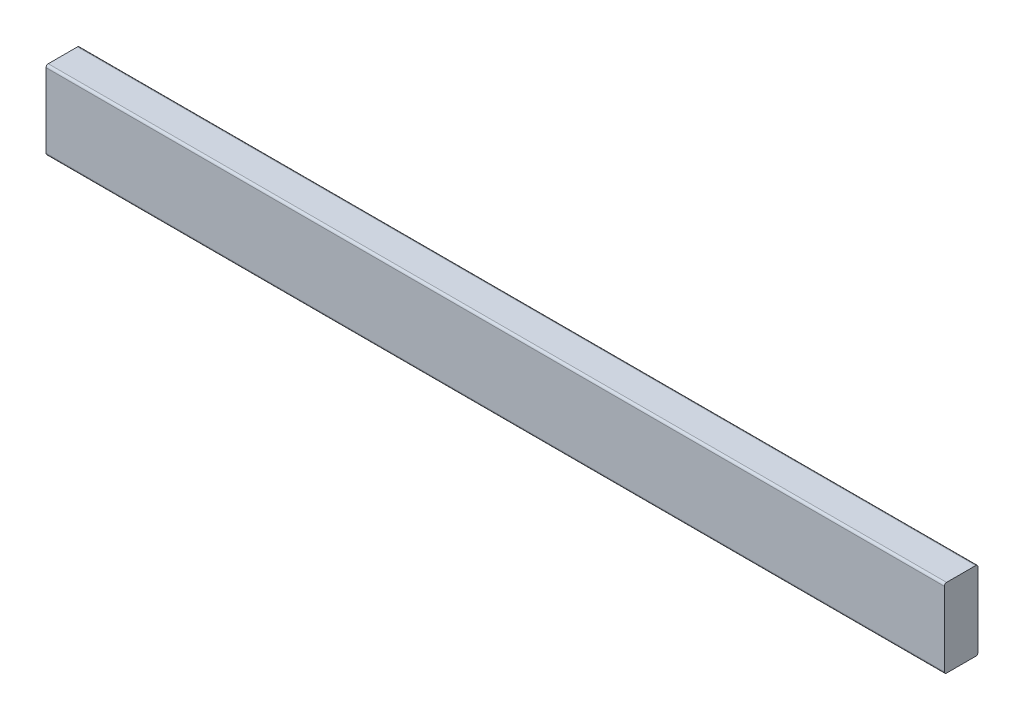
ISO-10303-21;
HEADER;
FILE_DESCRIPTION(('STEP AP214'),'2;1');
FILE_NAME('part.step','',(''),(''),'','','');
FILE_SCHEMA(('AUTOMOTIVE_DESIGN { 1 0 10303 214 1 1 1 1 }'));
ENDSEC;
DATA;
#1=APPLICATION_CONTEXT('core data for automotive mechanical design processes');
#2=APPLICATION_PROTOCOL_DEFINITION('international standard','automotive_design',2000,#1);
#3=PRODUCT_CONTEXT('',#1,'mechanical');
#4=PRODUCT('Part','Part','',(#3));
#5=PRODUCT_RELATED_PRODUCT_CATEGORY('part','',(#4));
#6=PRODUCT_DEFINITION_FORMATION('','',#4);
#7=PRODUCT_DEFINITION_CONTEXT('part definition',#1,'design');
#8=PRODUCT_DEFINITION('design','',#6,#7);
#9=PRODUCT_DEFINITION_SHAPE('','',#8);
#10=(LENGTH_UNIT() NAMED_UNIT(*) SI_UNIT(.MILLI.,.METRE.));
#11=(NAMED_UNIT(*) PLANE_ANGLE_UNIT() SI_UNIT($,.RADIAN.));
#12=(NAMED_UNIT(*) SI_UNIT($,.STERADIAN.) SOLID_ANGLE_UNIT());
#13=UNCERTAINTY_MEASURE_WITH_UNIT(LENGTH_MEASURE(1.E-05),#10,'distance_accuracy_value','');
#14=(GEOMETRIC_REPRESENTATION_CONTEXT(3) GLOBAL_UNCERTAINTY_ASSIGNED_CONTEXT((#13)) GLOBAL_UNIT_ASSIGNED_CONTEXT((#10,
#11,#12)) REPRESENTATION_CONTEXT('',''));
#15=CARTESIAN_POINT('',(0.,0.,0.));
#16=DIRECTION('',(0.,0.,1.));
#17=DIRECTION('',(1.,0.,0.));
#18=AXIS2_PLACEMENT_3D('',#15,#16,#17);
#19=CARTESIAN_POINT('',(508.,-44.45,-19.05));
#20=DIRECTION('',(0.,0.,1.));
#21=DIRECTION('',(1.,0.,0.));
#22=AXIS2_PLACEMENT_3D('',#19,#20,#21);
#23=PLANE('',#22);
#24=DIRECTION('',(0.,1.,0.));
#25=VECTOR('',#24,1.);
#26=CARTESIAN_POINT('',(508.,-44.45,-19.05));
#27=LINE('',#26,#25);
#28=CARTESIAN_POINT('',(508.,-41.91,-19.05));
#29=VERTEX_POINT('',#28);
#30=CARTESIAN_POINT('',(508.,41.91,-19.05));
#31=VERTEX_POINT('',#30);
#32=EDGE_CURVE('E122',#29,#31,#27,.T.);
#33=ORIENTED_EDGE('',*,*,#32,.F.);
#34=DIRECTION('',(-1.,0.,0.));
#35=VECTOR('',#34,1.);
#36=CARTESIAN_POINT('',(508.,-41.91,-19.05));
#37=LINE('',#36,#35);
#38=CARTESIAN_POINT('',(-508.,-41.91,-19.05));
#39=VERTEX_POINT('',#38);
#40=EDGE_CURVE('E148',#29,#39,#37,.T.);
#41=ORIENTED_EDGE('',*,*,#40,.T.);
#42=DIRECTION('',(0.,1.,0.));
#43=VECTOR('',#42,1.);
#44=CARTESIAN_POINT('',(-508.,-44.45,-19.05));
#45=LINE('',#44,#43);
#46=CARTESIAN_POINT('',(-508.,41.91,-19.05));
#47=VERTEX_POINT('',#46);
#48=EDGE_CURVE('E154',#39,#47,#45,.T.);
#49=ORIENTED_EDGE('',*,*,#48,.T.);
#50=DIRECTION('',(-1.,0.,0.));
#51=VECTOR('',#50,1.);
#52=CARTESIAN_POINT('',(508.,41.91,-19.05));
#53=LINE('',#52,#51);
#54=EDGE_CURVE('E146',#47,#31,#53,.F.);
#55=ORIENTED_EDGE('',*,*,#54,.T.);
#56=EDGE_LOOP('',(#33,#41,#49,#55));
#57=FACE_BOUND('',#56,.T.);
#58=ADVANCED_FACE('F30',(#57),#23,.F.);
#59=CARTESIAN_POINT('',(508.,44.45,19.05));
#60=DIRECTION('',(0.,-1.,0.));
#61=DIRECTION('',(0.,0.,-1.));
#62=AXIS2_PLACEMENT_3D('',#59,#60,#61);
#63=PLANE('',#62);
#64=DIRECTION('',(0.,0.,1.));
#65=VECTOR('',#64,1.);
#66=CARTESIAN_POINT('',(508.,44.45,19.05));
#67=LINE('',#66,#65);
#68=CARTESIAN_POINT('',(508.,44.45,-16.51));
#69=VERTEX_POINT('',#68);
#70=CARTESIAN_POINT('',(508.,44.45,16.51));
#71=VERTEX_POINT('',#70);
#72=EDGE_CURVE('E125',#69,#71,#67,.T.);
#73=ORIENTED_EDGE('',*,*,#72,.F.);
#74=DIRECTION('',(-1.,0.,0.));
#75=VECTOR('',#74,1.);
#76=CARTESIAN_POINT('',(508.,44.45,-16.51));
#77=LINE('',#76,#75);
#78=CARTESIAN_POINT('',(-508.,44.45,-16.51));
#79=VERTEX_POINT('',#78);
#80=EDGE_CURVE('E11',#69,#79,#77,.T.);
#81=ORIENTED_EDGE('',*,*,#80,.T.);
#82=DIRECTION('',(0.,0.,1.));
#83=VECTOR('',#82,1.);
#84=CARTESIAN_POINT('',(-508.,44.45,19.05));
#85=LINE('',#84,#83);
#86=CARTESIAN_POINT('',(-508.,44.45,16.51));
#87=VERTEX_POINT('',#86);
#88=EDGE_CURVE('E127',#79,#87,#85,.T.);
#89=ORIENTED_EDGE('',*,*,#88,.T.);
#90=DIRECTION('',(-1.,0.,0.));
#91=VECTOR('',#90,1.);
#92=CARTESIAN_POINT('',(508.,44.45,16.51));
#93=LINE('',#92,#91);
#94=EDGE_CURVE('E38',#87,#71,#93,.F.);
#95=ORIENTED_EDGE('',*,*,#94,.T.);
#96=EDGE_LOOP('',(#73,#81,#89,#95));
#97=FACE_BOUND('',#96,.T.);
#98=ADVANCED_FACE('F173',(#97),#63,.F.);
#99=CARTESIAN_POINT('',(508.,-44.45,19.05));
#100=DIRECTION('',(0.,0.,-1.));
#101=DIRECTION('',(-1.,0.,0.));
#102=AXIS2_PLACEMENT_3D('',#99,#100,#101);
#103=PLANE('',#102);
#104=DIRECTION('',(0.,-1.,0.));
#105=VECTOR('',#104,1.);
#106=CARTESIAN_POINT('',(-508.,-44.45,19.05));
#107=LINE('',#106,#105);
#108=CARTESIAN_POINT('',(-508.,41.91,19.05));
#109=VERTEX_POINT('',#108);
#110=CARTESIAN_POINT('',(-508.,-41.91,19.05));
#111=VERTEX_POINT('',#110);
#112=EDGE_CURVE('E123',#109,#111,#107,.T.);
#113=ORIENTED_EDGE('',*,*,#112,.T.);
#114=DIRECTION('',(-1.,0.,0.));
#115=VECTOR('',#114,1.);
#116=CARTESIAN_POINT('',(508.,-41.91,19.05));
#117=LINE('',#116,#115);
#118=CARTESIAN_POINT('',(508.,-41.91,19.05));
#119=VERTEX_POINT('',#118);
#120=EDGE_CURVE('E101',#111,#119,#117,.F.);
#121=ORIENTED_EDGE('',*,*,#120,.T.);
#122=DIRECTION('',(0.,-1.,0.));
#123=VECTOR('',#122,1.);
#124=CARTESIAN_POINT('',(508.,-44.45,19.05));
#125=LINE('',#124,#123);
#126=CARTESIAN_POINT('',(508.,41.91,19.05));
#127=VERTEX_POINT('',#126);
#128=EDGE_CURVE('E162',#127,#119,#125,.T.);
#129=ORIENTED_EDGE('',*,*,#128,.F.);
#130=DIRECTION('',(-1.,0.,0.));
#131=VECTOR('',#130,1.);
#132=CARTESIAN_POINT('',(508.,41.91,19.05));
#133=LINE('',#132,#131);
#134=EDGE_CURVE('E106',#127,#109,#133,.T.);
#135=ORIENTED_EDGE('',*,*,#134,.T.);
#136=EDGE_LOOP('',(#113,#121,#129,#135));
#137=FACE_BOUND('',#136,.T.);
#138=ADVANCED_FACE('F172',(#137),#103,.F.);
#139=CARTESIAN_POINT('',(508.,-44.45,19.05));
#140=DIRECTION('',(0.,1.,0.));
#141=DIRECTION('',(0.,0.,1.));
#142=AXIS2_PLACEMENT_3D('',#139,#140,#141);
#143=PLANE('',#142);
#144=DIRECTION('',(0.,0.,-1.));
#145=VECTOR('',#144,1.);
#146=CARTESIAN_POINT('',(508.,-44.45,19.05));
#147=LINE('',#146,#145);
#148=CARTESIAN_POINT('',(508.,-44.45,16.51));
#149=VERTEX_POINT('',#148);
#150=CARTESIAN_POINT('',(508.,-44.45,-16.51));
#151=VERTEX_POINT('',#150);
#152=EDGE_CURVE('E116',#149,#151,#147,.T.);
#153=ORIENTED_EDGE('',*,*,#152,.F.);
#154=DIRECTION('',(-1.,0.,0.));
#155=VECTOR('',#154,1.);
#156=CARTESIAN_POINT('',(508.,-44.45,16.51));
#157=LINE('',#156,#155);
#158=CARTESIAN_POINT('',(-508.,-44.45,16.51));
#159=VERTEX_POINT('',#158);
#160=EDGE_CURVE('E100',#149,#159,#157,.T.);
#161=ORIENTED_EDGE('',*,*,#160,.T.);
#162=DIRECTION('',(0.,0.,-1.));
#163=VECTOR('',#162,1.);
#164=CARTESIAN_POINT('',(-508.,-44.45,19.05));
#165=LINE('',#164,#163);
#166=CARTESIAN_POINT('',(-508.,-44.45,-16.51));
#167=VERTEX_POINT('',#166);
#168=EDGE_CURVE('E113',#159,#167,#165,.T.);
#169=ORIENTED_EDGE('',*,*,#168,.T.);
#170=DIRECTION('',(-1.,0.,0.));
#171=VECTOR('',#170,1.);
#172=CARTESIAN_POINT('',(508.,-44.45,-16.51));
#173=LINE('',#172,#171);
#174=EDGE_CURVE('E118',#167,#151,#173,.F.);
#175=ORIENTED_EDGE('',*,*,#174,.T.);
#176=EDGE_LOOP('',(#153,#161,#169,#175));
#177=FACE_BOUND('',#176,.T.);
#178=ADVANCED_FACE('F112',(#177),#143,.F.);
#179=CARTESIAN_POINT('',(508.,44.45,-19.05));
#180=DIRECTION('',(-1.,0.,0.));
#181=DIRECTION('',(0.,0.,1.));
#182=AXIS2_PLACEMENT_3D('',#179,#180,#181);
#183=PLANE('',#182);
#184=ORIENTED_EDGE('',*,*,#128,.T.);
#185=CARTESIAN_POINT('',(508.,-41.91,16.51));
#186=DIRECTION('',(-1.,0.,0.));
#187=DIRECTION('',(0.,0.,1.));
#188=AXIS2_PLACEMENT_3D('',#185,#186,#187);
#189=CIRCLE('',#188,2.54);
#190=EDGE_CURVE('E144',#119,#149,#189,.F.);
#191=ORIENTED_EDGE('',*,*,#190,.T.);
#192=ORIENTED_EDGE('',*,*,#152,.T.);
#193=CARTESIAN_POINT('',(508.,-41.91,-16.51));
#194=DIRECTION('',(-1.,0.,0.));
#195=DIRECTION('',(0.,0.,1.));
#196=AXIS2_PLACEMENT_3D('',#193,#194,#195);
#197=CIRCLE('',#196,2.54);
#198=EDGE_CURVE('E142',#151,#29,#197,.F.);
#199=ORIENTED_EDGE('',*,*,#198,.T.);
#200=ORIENTED_EDGE('',*,*,#32,.T.);
#201=CARTESIAN_POINT('',(508.,41.91,-16.51));
#202=DIRECTION('',(-1.,0.,0.));
#203=DIRECTION('',(0.,0.,1.));
#204=AXIS2_PLACEMENT_3D('',#201,#202,#203);
#205=CIRCLE('',#204,2.54);
#206=EDGE_CURVE('E51',#31,#69,#205,.F.);
#207=ORIENTED_EDGE('',*,*,#206,.T.);
#208=ORIENTED_EDGE('',*,*,#72,.T.);
#209=CARTESIAN_POINT('',(508.,41.91,16.51));
#210=DIRECTION('',(-1.,0.,0.));
#211=DIRECTION('',(0.,0.,1.));
#212=AXIS2_PLACEMENT_3D('',#209,#210,#211);
#213=CIRCLE('',#212,2.54);
#214=EDGE_CURVE('E139',#71,#127,#213,.F.);
#215=ORIENTED_EDGE('',*,*,#214,.T.);
#216=EDGE_LOOP('',(#184,#191,#192,#199,#200,#207,#208,#215));
#217=FACE_BOUND('',#216,.T.);
#218=ADVANCED_FACE('F166',(#217),#183,.F.);
#219=CARTESIAN_POINT('',(-508.,44.45,-19.05));
#220=DIRECTION('',(-1.,0.,0.));
#221=DIRECTION('',(0.,0.,1.));
#222=AXIS2_PLACEMENT_3D('',#219,#220,#221);
#223=PLANE('',#222);
#224=ORIENTED_EDGE('',*,*,#168,.F.);
#225=CARTESIAN_POINT('',(-508.,-41.91,16.51));
#226=DIRECTION('',(-1.,0.,0.));
#227=DIRECTION('',(0.,0.,1.));
#228=AXIS2_PLACEMENT_3D('',#225,#226,#227);
#229=CIRCLE('',#228,2.54);
#230=EDGE_CURVE('E96',#159,#111,#229,.T.);
#231=ORIENTED_EDGE('',*,*,#230,.T.);
#232=ORIENTED_EDGE('',*,*,#112,.F.);
#233=CARTESIAN_POINT('',(-508.,41.91,16.51));
#234=DIRECTION('',(-1.,0.,0.));
#235=DIRECTION('',(0.,0.,1.));
#236=AXIS2_PLACEMENT_3D('',#233,#234,#235);
#237=CIRCLE('',#236,2.54);
#238=EDGE_CURVE('E117',#109,#87,#237,.T.);
#239=ORIENTED_EDGE('',*,*,#238,.T.);
#240=ORIENTED_EDGE('',*,*,#88,.F.);
#241=CARTESIAN_POINT('',(-508.,41.91,-16.51));
#242=DIRECTION('',(-1.,0.,0.));
#243=DIRECTION('',(0.,0.,1.));
#244=AXIS2_PLACEMENT_3D('',#241,#242,#243);
#245=CIRCLE('',#244,2.54);
#246=EDGE_CURVE('E133',#79,#47,#245,.T.);
#247=ORIENTED_EDGE('',*,*,#246,.T.);
#248=ORIENTED_EDGE('',*,*,#48,.F.);
#249=CARTESIAN_POINT('',(-508.,-41.91,-16.51));
#250=DIRECTION('',(-1.,0.,0.));
#251=DIRECTION('',(0.,0.,1.));
#252=AXIS2_PLACEMENT_3D('',#249,#250,#251);
#253=CIRCLE('',#252,2.54);
#254=EDGE_CURVE('E107',#39,#167,#253,.T.);
#255=ORIENTED_EDGE('',*,*,#254,.T.);
#256=EDGE_LOOP('',(#224,#231,#232,#239,#240,#247,#248,#255));
#257=FACE_BOUND('',#256,.T.);
#258=ADVANCED_FACE('F120',(#257),#223,.T.);
#259=CARTESIAN_POINT('',(508.,-41.91,16.51));
#260=DIRECTION('',(-1.,0.,0.));
#261=DIRECTION('',(0.,0.,1.));
#262=AXIS2_PLACEMENT_3D('',#259,#260,#261);
#263=CYLINDRICAL_SURFACE('',#262,2.54);
#264=ORIENTED_EDGE('',*,*,#190,.F.);
#265=ORIENTED_EDGE('',*,*,#120,.F.);
#266=ORIENTED_EDGE('',*,*,#230,.F.);
#267=ORIENTED_EDGE('',*,*,#160,.F.);
#268=EDGE_LOOP('',(#264,#265,#266,#267));
#269=FACE_BOUND('',#268,.T.);
#270=ADVANCED_FACE('F99',(#269),#263,.T.);
#271=CARTESIAN_POINT('',(508.,-41.91,-16.51));
#272=DIRECTION('',(-1.,0.,0.));
#273=DIRECTION('',(0.,0.,1.));
#274=AXIS2_PLACEMENT_3D('',#271,#272,#273);
#275=CYLINDRICAL_SURFACE('',#274,2.54);
#276=ORIENTED_EDGE('',*,*,#198,.F.);
#277=ORIENTED_EDGE('',*,*,#174,.F.);
#278=ORIENTED_EDGE('',*,*,#254,.F.);
#279=ORIENTED_EDGE('',*,*,#40,.F.);
#280=EDGE_LOOP('',(#276,#277,#278,#279));
#281=FACE_BOUND('',#280,.T.);
#282=ADVANCED_FACE('F176',(#281),#275,.T.);
#283=CARTESIAN_POINT('',(508.,41.91,-16.51));
#284=DIRECTION('',(-1.,0.,0.));
#285=DIRECTION('',(0.,0.,1.));
#286=AXIS2_PLACEMENT_3D('',#283,#284,#285);
#287=CYLINDRICAL_SURFACE('',#286,2.54);
#288=ORIENTED_EDGE('',*,*,#206,.F.);
#289=ORIENTED_EDGE('',*,*,#54,.F.);
#290=ORIENTED_EDGE('',*,*,#246,.F.);
#291=ORIENTED_EDGE('',*,*,#80,.F.);
#292=EDGE_LOOP('',(#288,#289,#290,#291));
#293=FACE_BOUND('',#292,.T.);
#294=ADVANCED_FACE('F175',(#293),#287,.T.);
#295=CARTESIAN_POINT('',(508.,41.91,16.51));
#296=DIRECTION('',(-1.,0.,0.));
#297=DIRECTION('',(0.,0.,1.));
#298=AXIS2_PLACEMENT_3D('',#295,#296,#297);
#299=CYLINDRICAL_SURFACE('',#298,2.54);
#300=ORIENTED_EDGE('',*,*,#214,.F.);
#301=ORIENTED_EDGE('',*,*,#94,.F.);
#302=ORIENTED_EDGE('',*,*,#238,.F.);
#303=ORIENTED_EDGE('',*,*,#134,.F.);
#304=EDGE_LOOP('',(#300,#301,#302,#303));
#305=FACE_BOUND('',#304,.T.);
#306=ADVANCED_FACE('F32',(#305),#299,.T.);
#307=CLOSED_SHELL('',(#58,#98,#138,#178,#218,#258,#270,#282,#294,#306));
#308=MANIFOLD_SOLID_BREP('B2',#307);
#309=ADVANCED_BREP_SHAPE_REPRESENTATION('',(#18,#308),#14);
#310=SHAPE_DEFINITION_REPRESENTATION(#9,#309);
ENDSEC;
END-ISO-10303-21;
